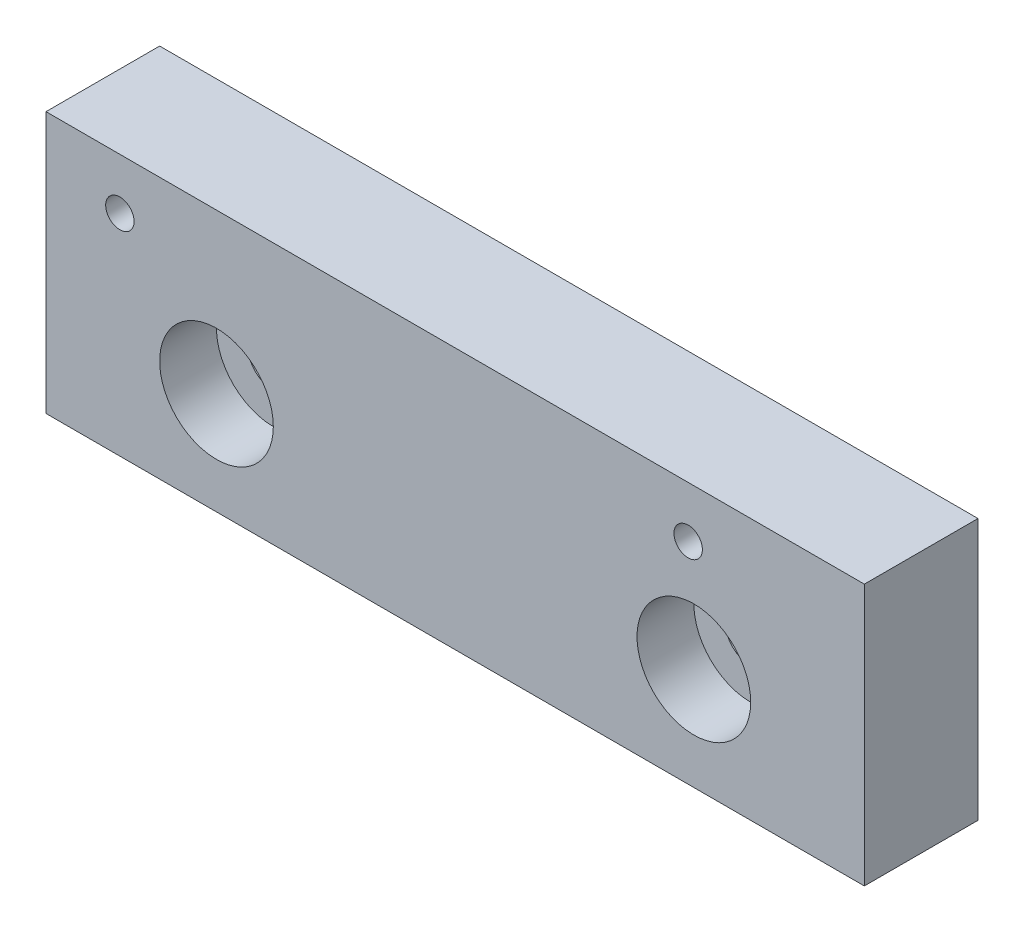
from build123d import *

# Parameters (mm, degrees)
ESQUISSE1_W             = 72
ESQUISSE1_H             = 23
ESQUISSE1_R             = 1.15
ESQUISSE1_R_2           = 2.25
BASE_EXTRUSION_DEPTH    = 10
ESQUISSE2_R             = 5
ESQUISSE2_R_2           = 1.25
ENL_V_MAT_EXTRU_1_DEPTH = 5


with BuildPart() as part:
    # Esquisse1 → Base-Extrusion (new body)
    with BuildSketch(Plane.XY):
        Rectangle(ESQUISSE1_W, ESQUISSE1_H)
        with Locations((-29.5, 7)):
            Circle(ESQUISSE1_R, mode=Mode.SUBTRACT)
        with Locations((20.5, 7)):
            Circle(ESQUISSE1_R, mode=Mode.SUBTRACT)
        with Locations((-21, -2.5)):
            Circle(ESQUISSE1_R_2, mode=Mode.SUBTRACT)
        with Locations((21, -2.5)):
            Circle(ESQUISSE1_R_2, mode=Mode.SUBTRACT)
    extrude(amount=BASE_EXTRUSION_DEPTH)

    # Esquisse2 → Enl_v. mat.-Extru.1 (cut)
    with BuildSketch(Plane.XY.offset(10)):
        with Locations((21, -2.5)):
            Circle(ESQUISSE2_R)
        with Locations((-21, -2.5)):
            Circle(ESQUISSE2_R)
        with Locations((-29.5, 7)):
            Circle(ESQUISSE2_R_2)
        with Locations((20.5, 7)):
            Circle(ESQUISSE2_R_2)
    extrude(amount=-ENL_V_MAT_EXTRU_1_DEPTH, mode=Mode.SUBTRACT)


solid = part.part
